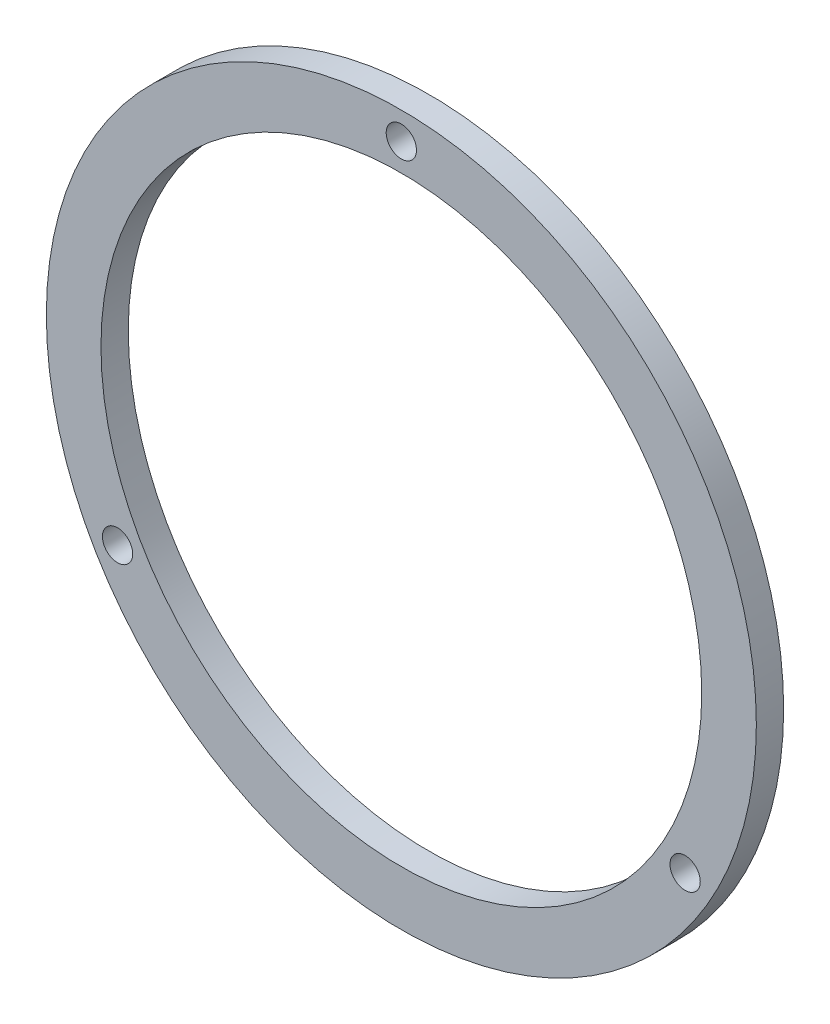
ISO-10303-21;
HEADER;
FILE_DESCRIPTION(('STEP AP214'),'2;1');
FILE_NAME('part.step','',(''),(''),'','','');
FILE_SCHEMA(('AUTOMOTIVE_DESIGN { 1 0 10303 214 1 1 1 1 }'));
ENDSEC;
DATA;
#1=APPLICATION_CONTEXT('core data for automotive mechanical design processes');
#2=APPLICATION_PROTOCOL_DEFINITION('international standard','automotive_design',2000,#1);
#3=PRODUCT_CONTEXT('',#1,'mechanical');
#4=PRODUCT('Part','Part','',(#3));
#5=PRODUCT_RELATED_PRODUCT_CATEGORY('part','',(#4));
#6=PRODUCT_DEFINITION_FORMATION('','',#4);
#7=PRODUCT_DEFINITION_CONTEXT('part definition',#1,'design');
#8=PRODUCT_DEFINITION('design','',#6,#7);
#9=PRODUCT_DEFINITION_SHAPE('','',#8);
#10=(LENGTH_UNIT() NAMED_UNIT(*) SI_UNIT(.MILLI.,.METRE.));
#11=(NAMED_UNIT(*) PLANE_ANGLE_UNIT() SI_UNIT($,.RADIAN.));
#12=(NAMED_UNIT(*) SI_UNIT($,.STERADIAN.) SOLID_ANGLE_UNIT());
#13=UNCERTAINTY_MEASURE_WITH_UNIT(LENGTH_MEASURE(1.E-05),#10,'distance_accuracy_value','');
#14=(GEOMETRIC_REPRESENTATION_CONTEXT(3) GLOBAL_UNCERTAINTY_ASSIGNED_CONTEXT((#13)) GLOBAL_UNIT_ASSIGNED_CONTEXT((#10,
#11,#12)) REPRESENTATION_CONTEXT('',''));
#15=CARTESIAN_POINT('',(0.,0.,0.));
#16=DIRECTION('',(0.,0.,1.));
#17=DIRECTION('',(1.,0.,0.));
#18=AXIS2_PLACEMENT_3D('',#15,#16,#17);
#19=CARTESIAN_POINT('',(0.,0.,6.35));
#20=DIRECTION('',(0.,0.,1.));
#21=DIRECTION('',(1.,0.,0.));
#22=AXIS2_PLACEMENT_3D('',#19,#20,#21);
#23=PLANE('',#22);
#24=CARTESIAN_POINT('',(0.,76.2,6.35));
#25=DIRECTION('',(0.,0.,1.));
#26=DIRECTION('',(1.,0.,0.));
#27=AXIS2_PLACEMENT_3D('',#24,#25,#26);
#28=CIRCLE('',#27,3.51789999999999);
#29=CARTESIAN_POINT('',(3.51789999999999,76.2,6.35));
#30=VERTEX_POINT('',#29);
#31=EDGE_CURVE('E66',#30,#30,#28,.T.);
#32=ORIENTED_EDGE('',*,*,#31,.F.);
#33=EDGE_LOOP('',(#32));
#34=FACE_BOUND('',#33,.T.);
#35=CARTESIAN_POINT('',(65.9911357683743,-38.0999999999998,6.35));
#36=DIRECTION('',(0.,0.,1.));
#37=DIRECTION('',(1.,0.,0.));
#38=AXIS2_PLACEMENT_3D('',#35,#36,#37);
#39=CIRCLE('',#38,3.51789999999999);
#40=CARTESIAN_POINT('',(69.5090357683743,-38.0999999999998,6.35));
#41=VERTEX_POINT('',#40);
#42=EDGE_CURVE('E60',#41,#41,#39,.T.);
#43=ORIENTED_EDGE('',*,*,#42,.F.);
#44=EDGE_LOOP('',(#43));
#45=FACE_BOUND('',#44,.T.);
#46=CARTESIAN_POINT('',(-65.9911357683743,-38.0999999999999,6.35));
#47=DIRECTION('',(0.,0.,1.));
#48=DIRECTION('',(1.,0.,0.));
#49=AXIS2_PLACEMENT_3D('',#46,#47,#48);
#50=CIRCLE('',#49,3.51789999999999);
#51=CARTESIAN_POINT('',(-62.4732357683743,-38.0999999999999,6.35));
#52=VERTEX_POINT('',#51);
#53=EDGE_CURVE('E54',#52,#52,#50,.T.);
#54=ORIENTED_EDGE('',*,*,#53,.F.);
#55=EDGE_LOOP('',(#54));
#56=FACE_BOUND('',#55,.T.);
#57=CARTESIAN_POINT('',(0.,0.,6.35));
#58=DIRECTION('',(0.,0.,1.));
#59=DIRECTION('',(1.,0.,0.));
#60=AXIS2_PLACEMENT_3D('',#57,#58,#59);
#61=CIRCLE('',#60,82.55);
#62=CARTESIAN_POINT('',(82.55,0.,6.35));
#63=VERTEX_POINT('',#62);
#64=EDGE_CURVE('E10',#63,#63,#61,.T.);
#65=ORIENTED_EDGE('',*,*,#64,.T.);
#66=EDGE_LOOP('',(#65));
#67=FACE_BOUND('',#66,.T.);
#68=CARTESIAN_POINT('',(0.,0.,6.35));
#69=DIRECTION('',(0.,0.,1.));
#70=DIRECTION('',(1.,0.,0.));
#71=AXIS2_PLACEMENT_3D('',#68,#69,#70);
#72=CIRCLE('',#71,69.85);
#73=CARTESIAN_POINT('',(69.85,0.,6.35));
#74=VERTEX_POINT('',#73);
#75=EDGE_CURVE('E44',#74,#74,#72,.T.);
#76=ORIENTED_EDGE('',*,*,#75,.F.);
#77=EDGE_LOOP('',(#76));
#78=FACE_BOUND('',#77,.T.);
#79=ADVANCED_FACE('F33',(#34,#45,#56,#67,#78),#23,.T.);
#80=CARTESIAN_POINT('',(0.,0.,0.));
#81=DIRECTION('',(0.,0.,1.));
#82=DIRECTION('',(1.,0.,0.));
#83=AXIS2_PLACEMENT_3D('',#80,#81,#82);
#84=PLANE('',#83);
#85=CARTESIAN_POINT('',(0.,76.2,0.));
#86=DIRECTION('',(0.,0.,1.));
#87=DIRECTION('',(1.,0.,0.));
#88=AXIS2_PLACEMENT_3D('',#85,#86,#87);
#89=CIRCLE('',#88,3.51789999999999);
#90=CARTESIAN_POINT('',(3.51789999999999,76.2,0.));
#91=VERTEX_POINT('',#90);
#92=EDGE_CURVE('E63',#91,#91,#89,.T.);
#93=ORIENTED_EDGE('',*,*,#92,.T.);
#94=EDGE_LOOP('',(#93));
#95=FACE_BOUND('',#94,.T.);
#96=CARTESIAN_POINT('',(65.9911357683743,-38.0999999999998,0.));
#97=DIRECTION('',(0.,0.,1.));
#98=DIRECTION('',(1.,0.,0.));
#99=AXIS2_PLACEMENT_3D('',#96,#97,#98);
#100=CIRCLE('',#99,3.51789999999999);
#101=CARTESIAN_POINT('',(69.5090357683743,-38.0999999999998,0.));
#102=VERTEX_POINT('',#101);
#103=EDGE_CURVE('E57',#102,#102,#100,.T.);
#104=ORIENTED_EDGE('',*,*,#103,.T.);
#105=EDGE_LOOP('',(#104));
#106=FACE_BOUND('',#105,.T.);
#107=CARTESIAN_POINT('',(-65.9911357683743,-38.0999999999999,0.));
#108=DIRECTION('',(0.,0.,1.));
#109=DIRECTION('',(1.,0.,0.));
#110=AXIS2_PLACEMENT_3D('',#107,#108,#109);
#111=CIRCLE('',#110,3.51789999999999);
#112=CARTESIAN_POINT('',(-62.4732357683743,-38.0999999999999,0.));
#113=VERTEX_POINT('',#112);
#114=EDGE_CURVE('E49',#113,#113,#111,.T.);
#115=ORIENTED_EDGE('',*,*,#114,.T.);
#116=EDGE_LOOP('',(#115));
#117=FACE_BOUND('',#116,.T.);
#118=CARTESIAN_POINT('',(0.,0.,0.));
#119=DIRECTION('',(0.,0.,1.));
#120=DIRECTION('',(1.,0.,0.));
#121=AXIS2_PLACEMENT_3D('',#118,#119,#120);
#122=CIRCLE('',#121,82.55);
#123=CARTESIAN_POINT('',(82.55,0.,0.));
#124=VERTEX_POINT('',#123);
#125=EDGE_CURVE('E37',#124,#124,#122,.T.);
#126=ORIENTED_EDGE('',*,*,#125,.F.);
#127=EDGE_LOOP('',(#126));
#128=FACE_BOUND('',#127,.T.);
#129=CARTESIAN_POINT('',(0.,0.,0.));
#130=DIRECTION('',(0.,0.,1.));
#131=DIRECTION('',(1.,0.,0.));
#132=AXIS2_PLACEMENT_3D('',#129,#130,#131);
#133=CIRCLE('',#132,69.85);
#134=CARTESIAN_POINT('',(69.85,0.,0.));
#135=VERTEX_POINT('',#134);
#136=EDGE_CURVE('E46',#135,#135,#133,.T.);
#137=ORIENTED_EDGE('',*,*,#136,.T.);
#138=EDGE_LOOP('',(#137));
#139=FACE_BOUND('',#138,.T.);
#140=ADVANCED_FACE('F74',(#95,#106,#117,#128,#139),#84,.F.);
#141=CARTESIAN_POINT('',(0.,0.,6.35));
#142=DIRECTION('',(0.,0.,-1.));
#143=DIRECTION('',(-1.,0.,0.));
#144=AXIS2_PLACEMENT_3D('',#141,#142,#143);
#145=CYLINDRICAL_SURFACE('',#144,82.55);
#146=ORIENTED_EDGE('',*,*,#64,.F.);
#147=EDGE_LOOP('',(#146));
#148=FACE_BOUND('',#147,.T.);
#149=ORIENTED_EDGE('',*,*,#125,.T.);
#150=EDGE_LOOP('',(#149));
#151=FACE_BOUND('',#150,.T.);
#152=ADVANCED_FACE('F35',(#148,#151),#145,.T.);
#153=CARTESIAN_POINT('',(0.,0.,6.35));
#154=DIRECTION('',(0.,0.,-1.));
#155=DIRECTION('',(-1.,0.,0.));
#156=AXIS2_PLACEMENT_3D('',#153,#154,#155);
#157=CYLINDRICAL_SURFACE('',#156,69.85);
#158=ORIENTED_EDGE('',*,*,#75,.T.);
#159=EDGE_LOOP('',(#158));
#160=FACE_BOUND('',#159,.T.);
#161=ORIENTED_EDGE('',*,*,#136,.F.);
#162=EDGE_LOOP('',(#161));
#163=FACE_BOUND('',#162,.T.);
#164=ADVANCED_FACE('F82',(#160,#163),#157,.F.);
#165=CARTESIAN_POINT('',(-65.9911357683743,-38.0999999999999,6.35));
#166=DIRECTION('',(0.,0.,1.));
#167=DIRECTION('',(1.,0.,0.));
#168=AXIS2_PLACEMENT_3D('',#165,#166,#167);
#169=CYLINDRICAL_SURFACE('',#168,3.51789999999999);
#170=ORIENTED_EDGE('',*,*,#114,.F.);
#171=EDGE_LOOP('',(#170));
#172=FACE_BOUND('',#171,.T.);
#173=ORIENTED_EDGE('',*,*,#53,.T.);
#174=EDGE_LOOP('',(#173));
#175=FACE_BOUND('',#174,.T.);
#176=ADVANCED_FACE('F85',(#172,#175),#169,.F.);
#177=CARTESIAN_POINT('',(65.9911357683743,-38.0999999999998,6.35));
#178=DIRECTION('',(0.,0.,1.));
#179=DIRECTION('',(1.,0.,0.));
#180=AXIS2_PLACEMENT_3D('',#177,#178,#179);
#181=CYLINDRICAL_SURFACE('',#180,3.51789999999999);
#182=ORIENTED_EDGE('',*,*,#103,.F.);
#183=EDGE_LOOP('',(#182));
#184=FACE_BOUND('',#183,.T.);
#185=ORIENTED_EDGE('',*,*,#42,.T.);
#186=EDGE_LOOP('',(#185));
#187=FACE_BOUND('',#186,.T.);
#188=ADVANCED_FACE('F99',(#184,#187),#181,.F.);
#189=CARTESIAN_POINT('',(0.,76.2,6.35));
#190=DIRECTION('',(0.,0.,1.));
#191=DIRECTION('',(1.,0.,0.));
#192=AXIS2_PLACEMENT_3D('',#189,#190,#191);
#193=CYLINDRICAL_SURFACE('',#192,3.51789999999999);
#194=ORIENTED_EDGE('',*,*,#92,.F.);
#195=EDGE_LOOP('',(#194));
#196=FACE_BOUND('',#195,.T.);
#197=ORIENTED_EDGE('',*,*,#31,.T.);
#198=EDGE_LOOP('',(#197));
#199=FACE_BOUND('',#198,.T.);
#200=ADVANCED_FACE('F70',(#196,#199),#193,.F.);
#201=CLOSED_SHELL('',(#79,#140,#152,#164,#176,#188,#200));
#202=MANIFOLD_SOLID_BREP('B2',#201);
#203=ADVANCED_BREP_SHAPE_REPRESENTATION('',(#18,#202),#14);
#204=SHAPE_DEFINITION_REPRESENTATION(#9,#203);
ENDSEC;
END-ISO-10303-21;
